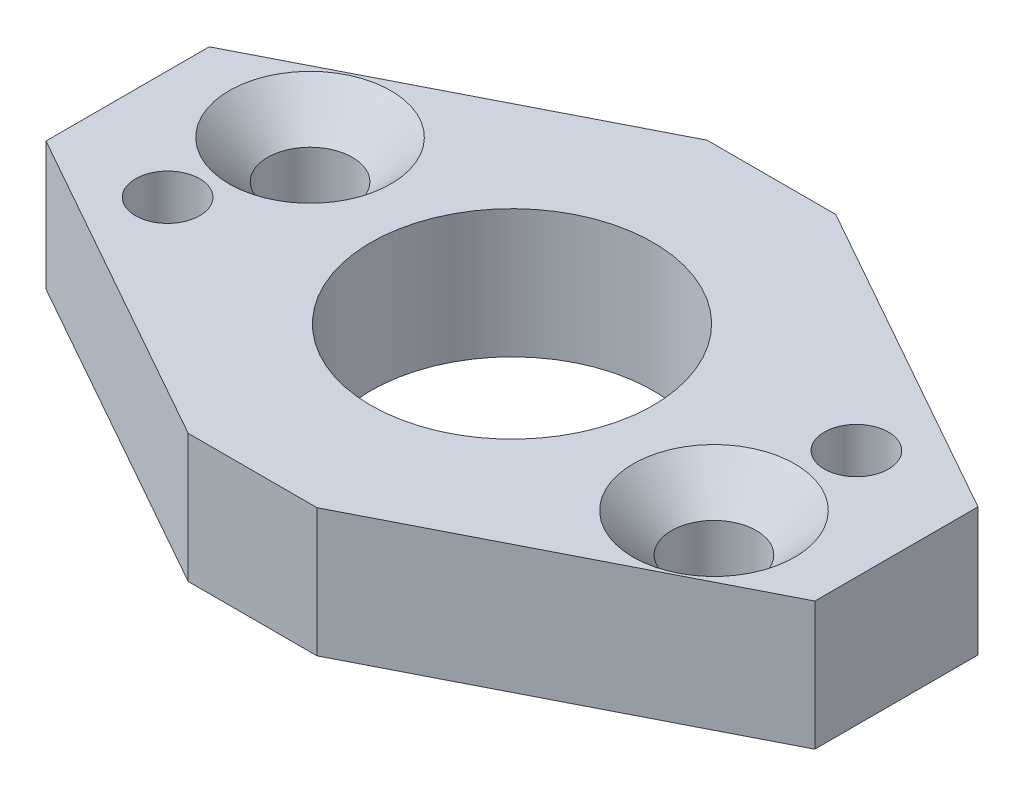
from build123d import *

# Parameters (mm, degrees)
SKETCH_1_W                   = 61
SKETCH_1_H                   = 40
EXTRUDE_1_DEPTH              = 10
SKETCH_2_R                   = 11
CUT_EXTRUDE_1_DEPTH          = 38.818646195
M6X1_0_1_D                   = 5
HOLE_WIZARD_M6_2_D           = 6.6
HOLE_WIZARD_M6_2_CSINK_D     = 12.6
HOLE_WIZARD_M6_2_CSINK_ANGLE = 90
CUT_EXTRUDE_2_DEPTH          = 38.818646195
PATTERN_CIRCULAR_1_COUNT     = 2


with BuildPart() as part:
    # Sketch 1 → Extrude 1 (new body)
    with BuildSketch(Plane(origin=(0, 0, 0), x_dir=(1, 0, 0), z_dir=(0, 1, 0))):
        Rectangle(SKETCH_1_W, SKETCH_1_H)
    extrude(amount=EXTRUDE_1_DEPTH)

    # Sketch 2 → Cut-Extrude 1 (cut, through all)
    with BuildSketch(Plane(origin=(0, 10, 0), x_dir=(1, 0, 0), z_dir=(0, 1, 0))):
        with Locations(Location((0, 0, 0), (0, 0, 270))):
            Circle(SKETCH_2_R)
    extrude(amount=-CUT_EXTRUDE_1_DEPTH, mode=Mode.SUBTRACT)

    # M6x1.0 _1 (through all)
    with Locations(Plane(origin=(0, 10, 0), x_dir=(1, 0, 0), z_dir=(0, 1, 0))):
        with Locations((-21.96666016, -4.869891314), (21.96666016, 4.869891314)):
            Hole(M6X1_0_1_D / 2)

    # Hole Wizard M6 _2 (through all)
    with Locations(Plane(origin=(0, 10, 0), x_dir=(1, 0, 0), z_dir=(0, 1, 0))):
        with Locations((-20.46177136, 4.723972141), (20.46177136, -4.723972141)):
            CounterSinkHole(HOLE_WIZARD_M6_2_D / 2, HOLE_WIZARD_M6_2_CSINK_D / 2, counter_sink_angle=HOLE_WIZARD_M6_2_CSINK_ANGLE)

    # Sketch 7 → Cut-Extrude 2 (cut, through all)
    with BuildSketch(Plane(origin=(0, 10, 0), x_dir=(1, 0, 0), z_dir=(0, 1, 0))):
        Polygon((-30.5, 6.903549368), (-4.802535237, 20), (-30.5, 20), align=None)
        Polygon((5.230174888, 20), (30.5, 20), (30.5, 5.813252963), align=None)
    cut_extrude_2 = extrude(amount=-CUT_EXTRUDE_2_DEPTH, mode=Mode.SUBTRACT)

    # Pattern Circular 1: Cut-Extrude 2 ×2 about axis
    pattern_circular_1_axis = Axis((0, 0, 0), (0, 1, 0))
    for i in range(1, PATTERN_CIRCULAR_1_COUNT):
        add(cut_extrude_2.rotate(pattern_circular_1_axis, i * 360 / PATTERN_CIRCULAR_1_COUNT), mode=Mode.SUBTRACT)


solid = part.part
